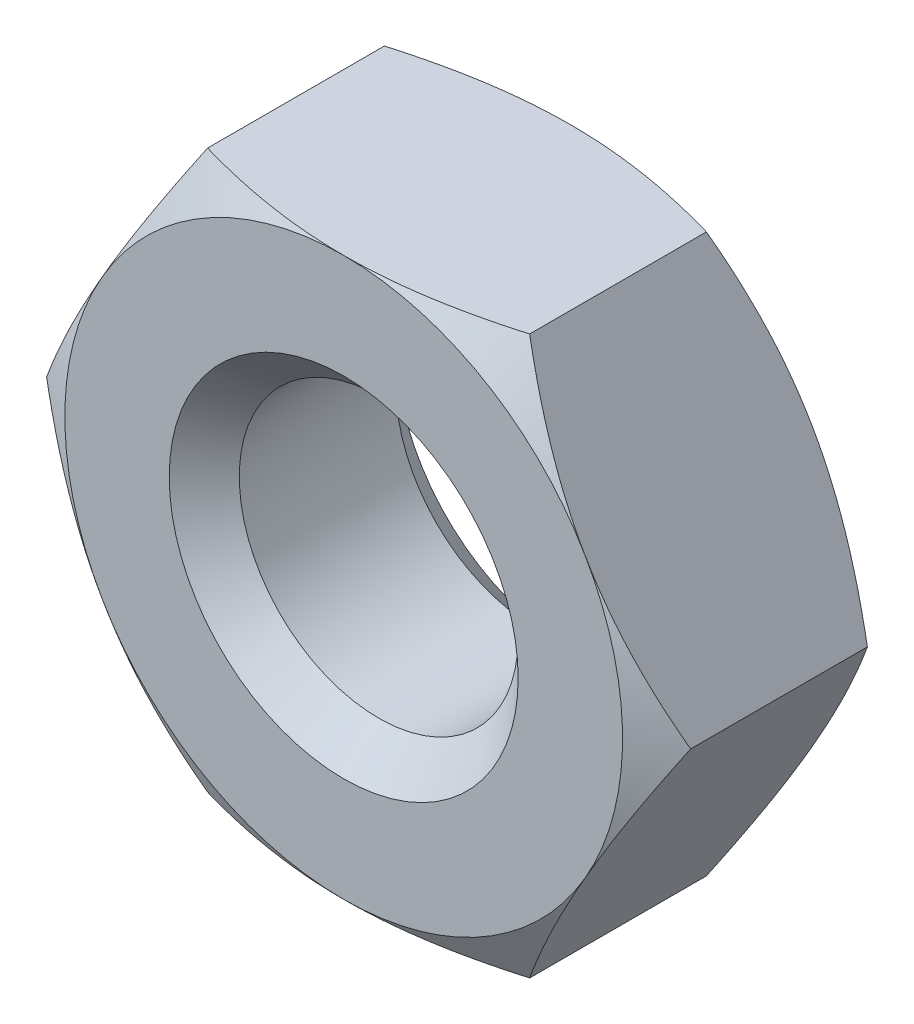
ISO-10303-21;
HEADER;
FILE_DESCRIPTION(('STEP AP214'),'2;1');
FILE_NAME('part.step','',(''),(''),'','','');
FILE_SCHEMA(('AUTOMOTIVE_DESIGN { 1 0 10303 214 1 1 1 1 }'));
ENDSEC;
DATA;
#1=APPLICATION_CONTEXT('core data for automotive mechanical design processes');
#2=APPLICATION_PROTOCOL_DEFINITION('international standard','automotive_design',2000,#1);
#3=PRODUCT_CONTEXT('',#1,'mechanical');
#4=PRODUCT('Part','Part','',(#3));
#5=PRODUCT_RELATED_PRODUCT_CATEGORY('part','',(#4));
#6=PRODUCT_DEFINITION_FORMATION('','',#4);
#7=PRODUCT_DEFINITION_CONTEXT('part definition',#1,'design');
#8=PRODUCT_DEFINITION('design','',#6,#7);
#9=PRODUCT_DEFINITION_SHAPE('','',#8);
#10=(LENGTH_UNIT() NAMED_UNIT(*) SI_UNIT(.MILLI.,.METRE.));
#11=(NAMED_UNIT(*) PLANE_ANGLE_UNIT() SI_UNIT($,.RADIAN.));
#12=(NAMED_UNIT(*) SI_UNIT($,.STERADIAN.) SOLID_ANGLE_UNIT());
#13=UNCERTAINTY_MEASURE_WITH_UNIT(LENGTH_MEASURE(1.E-05),#10,'distance_accuracy_value','');
#14=(GEOMETRIC_REPRESENTATION_CONTEXT(3) GLOBAL_UNCERTAINTY_ASSIGNED_CONTEXT((#13)) GLOBAL_UNIT_ASSIGNED_CONTEXT((#10,
#11,#12)) REPRESENTATION_CONTEXT('',''));
#15=CARTESIAN_POINT('',(0.,0.,0.));
#16=DIRECTION('',(0.,0.,1.));
#17=DIRECTION('',(1.,0.,0.));
#18=AXIS2_PLACEMENT_3D('',#15,#16,#17);
#19=CARTESIAN_POINT('',(0.,0.,1.3));
#20=DIRECTION('',(0.,0.,1.));
#21=DIRECTION('',(1.,0.,0.));
#22=AXIS2_PLACEMENT_3D('',#19,#20,#21);
#23=PLANE('',#22);
#24=CARTESIAN_POINT('',(0.,0.,1.29999999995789));
#25=DIRECTION('',(0.,0.,1.));
#26=DIRECTION('',(1.,0.,0.));
#27=AXIS2_PLACEMENT_3D('',#24,#25,#26);
#28=CIRCLE('',#27,1.00100415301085);
#29=CARTESIAN_POINT('',(1.00100415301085,0.,1.29999999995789));
#30=VERTEX_POINT('',#29);
#31=EDGE_CURVE('E127',#30,#30,#28,.F.);
#32=ORIENTED_EDGE('',*,*,#31,.T.);
#33=EDGE_LOOP('',(#32));
#34=FACE_BOUND('',#33,.T.);
#35=CARTESIAN_POINT('',(0.,0.,1.29999999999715));
#36=DIRECTION('',(0.,0.,-1.));
#37=DIRECTION('',(-1.,0.,0.));
#38=AXIS2_PLACEMENT_3D('',#35,#36,#37);
#39=CIRCLE('',#38,1.60000000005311);
#40=CARTESIAN_POINT('',(1.19651024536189E-11,1.60000000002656,1.30000000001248));
#41=VERTEX_POINT('',#40);
#42=CARTESIAN_POINT('',(1.38564064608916,0.799999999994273,1.30000000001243));
#43=VERTEX_POINT('',#42);
#44=EDGE_CURVE('E592',#41,#43,#39,.T.);
#45=ORIENTED_EDGE('',*,*,#44,.F.);
#46=CARTESIAN_POINT('',(0.,0.,1.29999999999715));
#47=DIRECTION('',(0.,0.,-1.));
#48=DIRECTION('',(-1.,0.,0.));
#49=AXIS2_PLACEMENT_3D('',#46,#47,#48);
#50=CIRCLE('',#49,1.60000000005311);
#51=CARTESIAN_POINT('',(-1.38564064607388,0.800000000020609,1.30000000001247));
#52=VERTEX_POINT('',#51);
#53=EDGE_CURVE('E593',#52,#41,#50,.T.);
#54=ORIENTED_EDGE('',*,*,#53,.F.);
#55=CARTESIAN_POINT('',(0.,0.,1.29999999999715));
#56=DIRECTION('',(0.,0.,-1.));
#57=DIRECTION('',(-1.,0.,0.));
#58=AXIS2_PLACEMENT_3D('',#55,#56,#57);
#59=CIRCLE('',#58,1.60000000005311);
#60=CARTESIAN_POINT('',(-1.38564064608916,-0.799999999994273,1.30000000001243));
#61=VERTEX_POINT('',#60);
#62=EDGE_CURVE('E122',#61,#52,#59,.T.);
#63=ORIENTED_EDGE('',*,*,#62,.F.);
#64=CARTESIAN_POINT('',(0.,0.,1.29999999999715));
#65=DIRECTION('',(0.,0.,-1.));
#66=DIRECTION('',(-1.,0.,0.));
#67=AXIS2_PLACEMENT_3D('',#64,#65,#66);
#68=CIRCLE('',#67,1.60000000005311);
#69=CARTESIAN_POINT('',(-1.19652485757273E-11,-1.60000000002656,1.30000000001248));
#70=VERTEX_POINT('',#69);
#71=EDGE_CURVE('E119',#70,#61,#68,.T.);
#72=ORIENTED_EDGE('',*,*,#71,.F.);
#73=CARTESIAN_POINT('',(0.,0.,1.29999999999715));
#74=DIRECTION('',(0.,0.,-1.));
#75=DIRECTION('',(-1.,0.,0.));
#76=AXIS2_PLACEMENT_3D('',#73,#74,#75);
#77=CIRCLE('',#76,1.60000000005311);
#78=CARTESIAN_POINT('',(1.38564064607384,-0.800000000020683,1.30000000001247));
#79=VERTEX_POINT('',#78);
#80=EDGE_CURVE('E20',#79,#70,#77,.T.);
#81=ORIENTED_EDGE('',*,*,#80,.F.);
#82=CARTESIAN_POINT('',(0.,0.,1.29999999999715));
#83=DIRECTION('',(0.,0.,-1.));
#84=DIRECTION('',(-1.,0.,0.));
#85=AXIS2_PLACEMENT_3D('',#82,#83,#84);
#86=CIRCLE('',#85,1.60000000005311);
#87=EDGE_CURVE('E104',#43,#79,#86,.T.);
#88=ORIENTED_EDGE('',*,*,#87,.F.);
#89=EDGE_LOOP('',(#45,#54,#63,#72,#81,#88));
#90=FACE_BOUND('',#89,.T.);
#91=ADVANCED_FACE('F17',(#34,#90),#23,.T.);
#92=CARTESIAN_POINT('',(0.,0.,1.15623632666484));
#93=DIRECTION('',(0.,0.,-1.));
#94=DIRECTION('',(-1.,0.,0.));
#95=AXIS2_PLACEMENT_3D('',#92,#93,#94);
#96=CONICAL_SURFACE('',#95,1.84900598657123,1.04719755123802);
#97=CARTESIAN_POINT('',(0.923760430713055,-1.59999999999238,1.15709376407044));
#98=CARTESIAN_POINT('',(0.848553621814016,-1.59999999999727,1.17880404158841));
#99=CARTESIAN_POINT('',(0.772764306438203,-1.59999999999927,1.19869688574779));
#100=CARTESIAN_POINT('',(0.620517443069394,-1.60000000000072,1.23377774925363));
#101=CARTESIAN_POINT('',(0.544065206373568,-1.60000000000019,1.24898903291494));
#102=CARTESIAN_POINT('',(0.390141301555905,-1.59999999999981,1.27388971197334));
#103=CARTESIAN_POINT('',(0.312668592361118,-1.59999999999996,1.2835729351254));
#104=CARTESIAN_POINT('',(0.1958784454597,-1.60000000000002,1.29337167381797));
#105=CARTESIAN_POINT('',(0.156749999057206,-1.60000000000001,1.29585047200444));
#106=CARTESIAN_POINT('',(0.0784161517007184,-1.59999999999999,1.29916729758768));
#107=CARTESIAN_POINT('',(0.0392107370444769,-1.59999999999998,1.30000500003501));
#108=CARTESIAN_POINT('',(-1.23193674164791E-11,-1.6,1.30000000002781));
#109=B_SPLINE_CURVE_WITH_KNOTS('',3,(#97,#98,#99,#100,#101,#102,#103,#104,#105,#106,#107,#108),
.UNSPECIFIED.,.F.,.F.,(4,2,2,2,2,4),(0.,0.234891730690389,0.468596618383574,0.702561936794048,
0.820151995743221,0.93776533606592),.UNSPECIFIED.);
#110=CARTESIAN_POINT('',(0.923760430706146,-1.60000000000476,1.15709376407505));
#111=VERTEX_POINT('',#110);
#112=EDGE_CURVE('E113',#111,#70,#109,.T.);
#113=ORIENTED_EDGE('',*,*,#112,.F.);
#114=CARTESIAN_POINT('',(1.38564064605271,-0.800000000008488,1.30000000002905));
#115=CARTESIAN_POINT('',(1.36603527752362,-0.833957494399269,1.30000500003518));
#116=CARTESIAN_POINT('',(1.34643257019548,-0.867910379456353,1.29916729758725));
#117=CARTESIAN_POINT('',(1.30726564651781,-0.935749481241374,1.29585047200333));
#118=CARTESIAN_POINT('',(1.28770142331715,-0.969635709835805,1.29337167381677));
#119=CARTESIAN_POINT('',(1.229306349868,-1.0707789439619,1.28357293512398));
#120=CARTESIAN_POINT('',(1.1905699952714,-1.137872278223,1.27388971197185));
#121=CARTESIAN_POINT('',(1.11360804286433,-1.27117429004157,1.24898903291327));
#122=CARTESIAN_POINT('',(1.07538192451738,-1.33738386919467,1.23377774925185));
#123=CARTESIAN_POINT('',(0.999258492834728,-1.4692335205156,1.19869688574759));
#124=CARTESIAN_POINT('',(0.961363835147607,-1.53486899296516,1.1788040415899));
#125=CARTESIAN_POINT('',(0.923760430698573,-1.60000000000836,1.15709376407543));
#126=B_SPLINE_CURVE_WITH_KNOTS('',3,(#114,#115,#116,#117,#118,#119,#120,#121,#122,#123,#124,
#125),.UNSPECIFIED.,.F.,.F.,(4,2,2,2,2,4),(0.,0.117613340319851,0.235203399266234,
0.469168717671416,0.702873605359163,0.937765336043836),.UNSPECIFIED.);
#127=EDGE_CURVE('E115',#79,#111,#126,.T.);
#128=ORIENTED_EDGE('',*,*,#127,.F.);
#129=ORIENTED_EDGE('',*,*,#80,.T.);
#130=EDGE_LOOP('',(#113,#128,#129));
#131=FACE_BOUND('',#130,.T.);
#132=ADVANCED_FACE('F111',(#131),#96,.T.);
#133=CARTESIAN_POINT('',(0.,0.,1.15623632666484));
#134=DIRECTION('',(0.,0.,-1.));
#135=DIRECTION('',(-1.,0.,0.));
#136=AXIS2_PLACEMENT_3D('',#133,#134,#135);
#137=CONICAL_SURFACE('',#136,1.84900598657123,1.04719755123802);
#138=CARTESIAN_POINT('',(1.84752086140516,1.22068261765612E-11,1.15709376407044));
#139=CARTESIAN_POINT('',(1.80991745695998,-0.0651310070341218,1.17880404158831));
#140=CARTESIAN_POINT('',(1.77202279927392,-0.130766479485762,1.19869688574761));
#141=CARTESIAN_POINT('',(1.69589936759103,-0.262616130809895,1.23377774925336));
#142=CARTESIAN_POINT('',(1.6576732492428,-0.328825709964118,1.24898903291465));
#143=CARTESIAN_POINT('',(1.58071129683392,-0.462127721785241,1.27388971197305));
#144=CARTESIAN_POINT('',(1.54197494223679,-0.529221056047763,1.28357293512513));
#145=CARTESIAN_POINT('',(1.48357986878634,-0.63036429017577,1.29337167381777));
#146=CARTESIAN_POINT('',(1.46401564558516,-0.664250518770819,1.29585047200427));
#147=CARTESIAN_POINT('',(1.42484872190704,-0.732089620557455,1.29916729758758));
#148=CARTESIAN_POINT('',(1.40524601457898,-0.766042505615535,1.30000500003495));
#149=CARTESIAN_POINT('',(1.38564064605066,-0.800000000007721,1.3000000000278));
#150=B_SPLINE_CURVE_WITH_KNOTS('',3,(#138,#139,#140,#141,#142,#143,#144,#145,#146,#147,#148,
#149),.UNSPECIFIED.,.F.,.F.,(4,2,2,2,2,4),(0.,0.234891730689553,0.468596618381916,
0.702561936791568,0.820151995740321,0.937765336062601),.UNSPECIFIED.);
#151=CARTESIAN_POINT('',(1.84752086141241,0.,1.15709376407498));
#152=VERTEX_POINT('',#151);
#153=EDGE_CURVE('E253',#152,#79,#150,.T.);
#154=ORIENTED_EDGE('',*,*,#153,.F.);
#155=CARTESIAN_POINT('',(1.38564064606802,0.799999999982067,1.30000000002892));
#156=CARTESIAN_POINT('',(1.40524601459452,0.76604250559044,1.30000500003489));
#157=CARTESIAN_POINT('',(1.4248487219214,0.732089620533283,1.29916729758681));
#158=CARTESIAN_POINT('',(1.46401564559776,0.664250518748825,1.29585047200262));
#159=CARTESIAN_POINT('',(1.48357986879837,0.63036429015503,1.29337167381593));
#160=CARTESIAN_POINT('',(1.54197494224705,0.529221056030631,1.28357293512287));
#161=CARTESIAN_POINT('',(1.5807112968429,0.462127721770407,1.27388971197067));
#162=CARTESIAN_POINT('',(1.65767324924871,0.328825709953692,1.24898903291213));
#163=CARTESIAN_POINT('',(1.69589936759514,0.262616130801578,1.23377774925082));
#164=CARTESIAN_POINT('',(1.77202279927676,0.1307664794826,1.19869688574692));
#165=CARTESIAN_POINT('',(1.80991745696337,0.0651310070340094,1.17880404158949));
#166=CARTESIAN_POINT('',(1.84752086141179,-8.29758985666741E-12,1.15709376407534));
#167=B_SPLINE_CURVE_WITH_KNOTS('',3,(#155,#156,#157,#158,#159,#160,#161,#162,#163,#164,#165,
#166),.UNSPECIFIED.,.F.,.F.,(4,2,2,2,2,4),(0.,0.117613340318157,0.235203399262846,
0.469168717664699,0.702873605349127,0.937765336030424),.UNSPECIFIED.);
#168=EDGE_CURVE('E273',#43,#152,#167,.T.);
#169=ORIENTED_EDGE('',*,*,#168,.F.);
#170=ORIENTED_EDGE('',*,*,#87,.T.);
#171=EDGE_LOOP('',(#154,#169,#170));
#172=FACE_BOUND('',#171,.T.);
#173=ADVANCED_FACE('F265',(#172),#137,.T.);
#174=CARTESIAN_POINT('',(0.,0.,1.15623632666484));
#175=DIRECTION('',(0.,0.,-1.));
#176=DIRECTION('',(-1.,0.,0.));
#177=AXIS2_PLACEMENT_3D('',#174,#175,#176);
#178=CONICAL_SURFACE('',#177,1.84900598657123,1.04719755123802);
#179=CARTESIAN_POINT('',(0.923760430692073,1.60000000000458,1.15709376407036));
#180=CARTESIAN_POINT('',(0.961363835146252,1.53486899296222,1.17880404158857));
#181=CARTESIAN_POINT('',(0.999258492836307,1.46923352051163,1.19869688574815));
#182=CARTESIAN_POINT('',(1.0753819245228,1.33738386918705,1.23377774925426));
#183=CARTESIAN_POINT('',(1.11360804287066,1.27117429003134,1.24898903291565));
#184=CARTESIAN_POINT('',(1.19056999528,1.13787227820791,1.27388971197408));
#185=CARTESIAN_POINT('',(1.22930634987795,1.07077894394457,1.28357293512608));
#186=CARTESIAN_POINT('',(1.28770142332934,0.969635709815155,1.29337167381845));
#187=CARTESIAN_POINT('',(1.3072656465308,0.935749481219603,1.29585047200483));
#188=CARTESIAN_POINT('',(1.34643257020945,0.867910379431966,1.29916729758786));
#189=CARTESIAN_POINT('',(1.36603527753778,0.833957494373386,1.30000500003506));
#190=CARTESIAN_POINT('',(1.3856406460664,0.799999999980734,1.30000000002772));
#191=B_SPLINE_CURVE_WITH_KNOTS('',3,(#179,#180,#181,#182,#183,#184,#185,#186,#187,#188,#189,
#190),.UNSPECIFIED.,.F.,.F.,(4,2,2,2,2,4),(0.,0.234891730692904,0.468596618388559,
0.702561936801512,0.820151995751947,0.937765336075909),.UNSPECIFIED.);
#192=CARTESIAN_POINT('',(0.923760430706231,1.60000000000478,1.15709376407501));
#193=VERTEX_POINT('',#192);
#194=EDGE_CURVE('E279',#193,#43,#191,.T.);
#195=ORIENTED_EDGE('',*,*,#194,.F.);
#196=CARTESIAN_POINT('',(1.19651184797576E-11,1.60000000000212,1.30000000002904));
#197=CARTESIAN_POINT('',(0.0392107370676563,1.60000000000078,1.30000500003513));
#198=CARTESIAN_POINT('',(0.0784161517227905,1.60000000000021,1.29916729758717));
#199=CARTESIAN_POINT('',(0.156749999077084,1.59999999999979,1.29585047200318));
#200=CARTESIAN_POINT('',(0.195878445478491,1.59999999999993,1.29337167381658));
#201=CARTESIAN_POINT('',(0.312668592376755,1.60000000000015,1.28357293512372));
#202=CARTESIAN_POINT('',(0.390141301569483,1.60000000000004,1.27388971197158));
#203=CARTESIAN_POINT('',(0.544065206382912,1.59999999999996,1.248989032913));
#204=CARTESIAN_POINT('',(0.620517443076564,1.59999999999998,1.23377774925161));
#205=CARTESIAN_POINT('',(0.772764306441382,1.60000000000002,1.19869688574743));
#206=CARTESIAN_POINT('',(0.848553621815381,1.60000000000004,1.17880404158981));
#207=CARTESIAN_POINT('',(0.923760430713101,1.6,1.15709376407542));
#208=B_SPLINE_CURVE_WITH_KNOTS('',3,(#196,#197,#198,#199,#200,#201,#202,#203,#204,#205,#206,
#207),.UNSPECIFIED.,.F.,.F.,(4,2,2,2,2,4),(0.,0.117613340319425,0.235203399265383,
0.469168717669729,0.702873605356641,0.937765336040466),.UNSPECIFIED.);
#209=EDGE_CURVE('E285',#41,#193,#208,.T.);
#210=ORIENTED_EDGE('',*,*,#209,.F.);
#211=ORIENTED_EDGE('',*,*,#44,.T.);
#212=EDGE_LOOP('',(#195,#210,#211));
#213=FACE_BOUND('',#212,.T.);
#214=ADVANCED_FACE('F270',(#213),#178,.T.);
#215=CARTESIAN_POINT('',(0.,0.,1.15623632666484));
#216=DIRECTION('',(0.,0.,-1.));
#217=DIRECTION('',(-1.,0.,0.));
#218=AXIS2_PLACEMENT_3D('',#215,#216,#217);
#219=CONICAL_SURFACE('',#218,1.84900598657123,1.04719755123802);
#220=CARTESIAN_POINT('',(-0.923760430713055,1.59999999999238,1.15709376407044));
#221=CARTESIAN_POINT('',(-0.848553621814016,1.59999999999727,1.17880404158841));
#222=CARTESIAN_POINT('',(-0.772764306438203,1.59999999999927,1.19869688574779));
#223=CARTESIAN_POINT('',(-0.620517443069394,1.60000000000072,1.23377774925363));
#224=CARTESIAN_POINT('',(-0.544065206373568,1.60000000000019,1.24898903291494));
#225=CARTESIAN_POINT('',(-0.390141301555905,1.59999999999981,1.27388971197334));
#226=CARTESIAN_POINT('',(-0.312668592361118,1.59999999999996,1.2835729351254));
#227=CARTESIAN_POINT('',(-0.1958784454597,1.60000000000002,1.29337167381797));
#228=CARTESIAN_POINT('',(-0.156749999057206,1.60000000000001,1.29585047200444));
#229=CARTESIAN_POINT('',(-0.0784161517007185,1.59999999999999,1.29916729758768));
#230=CARTESIAN_POINT('',(-0.0392107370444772,1.59999999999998,1.30000500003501));
#231=CARTESIAN_POINT('',(1.23191844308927E-11,1.6,1.30000000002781));
#232=B_SPLINE_CURVE_WITH_KNOTS('',3,(#220,#221,#222,#223,#224,#225,#226,#227,#228,#229,#230,
#231),.UNSPECIFIED.,.F.,.F.,(4,2,2,2,2,4),(0.,0.234891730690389,0.468596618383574,
0.702561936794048,0.82015199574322,0.937765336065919),.UNSPECIFIED.);
#233=CARTESIAN_POINT('',(-0.923760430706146,1.60000000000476,1.15709376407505));
#234=VERTEX_POINT('',#233);
#235=EDGE_CURVE('E291',#234,#41,#232,.T.);
#236=ORIENTED_EDGE('',*,*,#235,.F.);
#237=CARTESIAN_POINT('',(-1.38564064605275,0.800000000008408,1.30000000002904));
#238=CARTESIAN_POINT('',(-1.36603527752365,0.833957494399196,1.30000500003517));
#239=CARTESIAN_POINT('',(-1.34643257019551,0.867910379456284,1.29916729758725));
#240=CARTESIAN_POINT('',(-1.30726564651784,0.935749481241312,1.29585047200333));
#241=CARTESIAN_POINT('',(-1.28770142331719,0.969635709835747,1.29337167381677));
#242=CARTESIAN_POINT('',(-1.22930634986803,1.07077894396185,1.28357293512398));
#243=CARTESIAN_POINT('',(-1.19056999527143,1.13787227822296,1.27388971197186));
#244=CARTESIAN_POINT('',(-1.11360804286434,1.27117429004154,1.24898903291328));
#245=CARTESIAN_POINT('',(-1.07538192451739,1.33738386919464,1.23377774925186));
#246=CARTESIAN_POINT('',(-0.999258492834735,1.46923352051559,1.19869688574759));
#247=CARTESIAN_POINT('',(-0.961363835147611,1.53486899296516,1.1788040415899));
#248=CARTESIAN_POINT('',(-0.923760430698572,1.60000000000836,1.15709376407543));
#249=B_SPLINE_CURVE_WITH_KNOTS('',3,(#237,#238,#239,#240,#241,#242,#243,#244,#245,#246,#247,
#248),.UNSPECIFIED.,.F.,.F.,(4,2,2,2,2,4),(0.,0.117613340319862,0.235203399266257,
0.46916871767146,0.702873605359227,0.937765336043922),.UNSPECIFIED.);
#250=EDGE_CURVE('E390',#52,#234,#249,.T.);
#251=ORIENTED_EDGE('',*,*,#250,.F.);
#252=ORIENTED_EDGE('',*,*,#53,.T.);
#253=EDGE_LOOP('',(#236,#251,#252));
#254=FACE_BOUND('',#253,.T.);
#255=ADVANCED_FACE('F533',(#254),#219,.T.);
#256=CARTESIAN_POINT('',(0.,0.,1.15623632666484));
#257=DIRECTION('',(0.,0.,-1.));
#258=DIRECTION('',(-1.,0.,0.));
#259=AXIS2_PLACEMENT_3D('',#256,#257,#258);
#260=CONICAL_SURFACE('',#259,1.84900598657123,1.04719755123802);
#261=CARTESIAN_POINT('',(-1.84752086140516,-1.21961704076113E-11,1.15709376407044));
#262=CARTESIAN_POINT('',(-1.80991745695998,0.0651310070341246,1.17880404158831));
#263=CARTESIAN_POINT('',(-1.77202279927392,0.130766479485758,1.19869688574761));
#264=CARTESIAN_POINT('',(-1.69589936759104,0.262616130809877,1.23377774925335));
#265=CARTESIAN_POINT('',(-1.65767324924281,0.328825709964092,1.24898903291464));
#266=CARTESIAN_POINT('',(-1.58071129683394,0.462127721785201,1.27388971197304));
#267=CARTESIAN_POINT('',(-1.54197494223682,0.529221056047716,1.28357293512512));
#268=CARTESIAN_POINT('',(-1.48357986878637,0.630364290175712,1.29337167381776));
#269=CARTESIAN_POINT('',(-1.46401564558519,0.664250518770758,1.29585047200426));
#270=CARTESIAN_POINT('',(-1.42484872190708,0.732089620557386,1.29916729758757));
#271=CARTESIAN_POINT('',(-1.40524601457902,0.766042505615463,1.30000500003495));
#272=CARTESIAN_POINT('',(-1.38564064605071,0.800000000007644,1.3000000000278));
#273=B_SPLINE_CURVE_WITH_KNOTS('',3,(#261,#262,#263,#264,#265,#266,#267,#268,#269,#270,#271,
#272),.UNSPECIFIED.,.F.,.F.,(4,2,2,2,2,4),(0.,0.234891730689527,0.468596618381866,
0.702561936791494,0.820151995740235,0.937765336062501),.UNSPECIFIED.);
#274=CARTESIAN_POINT('',(-1.84752086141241,0.,1.15709376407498));
#275=VERTEX_POINT('',#274);
#276=EDGE_CURVE('E389',#275,#52,#273,.T.);
#277=ORIENTED_EDGE('',*,*,#276,.F.);
#278=CARTESIAN_POINT('',(-1.38564064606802,-0.799999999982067,1.30000000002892));
#279=CARTESIAN_POINT('',(-1.40524601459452,-0.766042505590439,1.30000500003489));
#280=CARTESIAN_POINT('',(-1.4248487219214,-0.732089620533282,1.29916729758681));
#281=CARTESIAN_POINT('',(-1.46401564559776,-0.664250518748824,1.29585047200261));
#282=CARTESIAN_POINT('',(-1.48357986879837,-0.630364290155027,1.29337167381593));
#283=CARTESIAN_POINT('',(-1.54197494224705,-0.529221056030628,1.28357293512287));
#284=CARTESIAN_POINT('',(-1.58071129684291,-0.462127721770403,1.27388971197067));
#285=CARTESIAN_POINT('',(-1.65767324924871,-0.328825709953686,1.24898903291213));
#286=CARTESIAN_POINT('',(-1.69589936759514,-0.262616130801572,1.23377774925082));
#287=CARTESIAN_POINT('',(-1.77202279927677,-0.130766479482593,1.19869688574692));
#288=CARTESIAN_POINT('',(-1.80991745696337,-0.065131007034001,1.17880404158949));
#289=CARTESIAN_POINT('',(-1.8475208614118,8.30657991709E-12,1.15709376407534));
#290=B_SPLINE_CURVE_WITH_KNOTS('',3,(#278,#279,#280,#281,#282,#283,#284,#285,#286,#287,#288,
#289),.UNSPECIFIED.,.F.,.F.,(4,2,2,2,2,4),(0.,0.117613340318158,0.235203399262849,
0.469168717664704,0.702873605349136,0.937765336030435),.UNSPECIFIED.);
#291=EDGE_CURVE('E177',#61,#275,#290,.T.);
#292=ORIENTED_EDGE('',*,*,#291,.F.);
#293=ORIENTED_EDGE('',*,*,#62,.T.);
#294=EDGE_LOOP('',(#277,#292,#293));
#295=FACE_BOUND('',#294,.T.);
#296=ADVANCED_FACE('F158',(#295),#260,.T.);
#297=CARTESIAN_POINT('',(0.,0.,1.15623632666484));
#298=DIRECTION('',(0.,0.,-1.));
#299=DIRECTION('',(-1.,0.,0.));
#300=AXIS2_PLACEMENT_3D('',#297,#298,#299);
#301=CONICAL_SURFACE('',#300,1.84900598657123,1.04719755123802);
#302=CARTESIAN_POINT('',(-0.923760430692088,-1.60000000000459,1.15709376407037));
#303=CARTESIAN_POINT('',(-0.961363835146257,-1.53486899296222,1.17880404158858));
#304=CARTESIAN_POINT('',(-0.999258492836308,-1.46923352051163,1.19869688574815));
#305=CARTESIAN_POINT('',(-1.0753819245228,-1.33738386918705,1.23377774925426));
#306=CARTESIAN_POINT('',(-1.11360804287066,-1.27117429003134,1.24898903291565));
#307=CARTESIAN_POINT('',(-1.19056999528,-1.13787227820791,1.27388971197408));
#308=CARTESIAN_POINT('',(-1.22930634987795,-1.07077894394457,1.28357293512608));
#309=CARTESIAN_POINT('',(-1.28770142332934,-0.969635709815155,1.29337167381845));
#310=CARTESIAN_POINT('',(-1.3072656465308,-0.935749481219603,1.29585047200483));
#311=CARTESIAN_POINT('',(-1.34643257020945,-0.867910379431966,1.29916729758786));
#312=CARTESIAN_POINT('',(-1.36603527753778,-0.833957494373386,1.30000500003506));
#313=CARTESIAN_POINT('',(-1.3856406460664,-0.799999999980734,1.30000000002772));
#314=B_SPLINE_CURVE_WITH_KNOTS('',3,(#302,#303,#304,#305,#306,#307,#308,#309,#310,#311,#312,
#313),.UNSPECIFIED.,.F.,.F.,(4,2,2,2,2,4),(0.,0.234891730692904,0.468596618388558,
0.702561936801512,0.820151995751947,0.937765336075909),.UNSPECIFIED.);
#315=CARTESIAN_POINT('',(-0.923760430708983,-1.60000000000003,1.15709376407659));
#316=VERTEX_POINT('',#315);
#317=EDGE_CURVE('E138',#316,#61,#314,.T.);
#318=ORIENTED_EDGE('',*,*,#317,.F.);
#319=CARTESIAN_POINT('',(-1.19652513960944E-11,-1.60000000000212,1.30000000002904));
#320=CARTESIAN_POINT('',(-0.0392107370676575,-1.60000000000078,1.30000500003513));
#321=CARTESIAN_POINT('',(-0.0784161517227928,-1.60000000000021,1.29916729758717));
#322=CARTESIAN_POINT('',(-0.156749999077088,-1.59999999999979,1.29585047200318));
#323=CARTESIAN_POINT('',(-0.195878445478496,-1.59999999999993,1.29337167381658));
#324=CARTESIAN_POINT('',(-0.312668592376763,-1.60000000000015,1.28357293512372));
#325=CARTESIAN_POINT('',(-0.390141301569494,-1.60000000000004,1.27388971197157));
#326=CARTESIAN_POINT('',(-0.544065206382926,-1.59999999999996,1.248989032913));
#327=CARTESIAN_POINT('',(-0.62051744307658,-1.59999999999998,1.2337777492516));
#328=CARTESIAN_POINT('',(-0.772764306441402,-1.60000000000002,1.19869688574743));
#329=CARTESIAN_POINT('',(-0.848553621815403,-1.60000000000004,1.1788040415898));
#330=CARTESIAN_POINT('',(-0.923760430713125,-1.6,1.15709376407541));
#331=B_SPLINE_CURVE_WITH_KNOTS('',3,(#319,#320,#321,#322,#323,#324,#325,#326,#327,#328,#329,
#330),.UNSPECIFIED.,.F.,.F.,(4,2,2,2,2,4),(0.,0.117613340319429,0.23520339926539,
0.469168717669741,0.702873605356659,0.937765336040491),.UNSPECIFIED.);
#332=EDGE_CURVE('E132',#70,#316,#331,.T.);
#333=ORIENTED_EDGE('',*,*,#332,.F.);
#334=ORIENTED_EDGE('',*,*,#71,.T.);
#335=EDGE_LOOP('',(#318,#333,#334));
#336=FACE_BOUND('',#335,.T.);
#337=ADVANCED_FACE('F137',(#336),#301,.T.);
#338=CARTESIAN_POINT('',(0.,0.,1.29999999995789));
#339=DIRECTION('',(0.,0.,1.));
#340=DIRECTION('',(1.,0.,0.));
#341=AXIS2_PLACEMENT_3D('',#338,#339,#340);
#342=CONICAL_SURFACE('',#341,1.00100415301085,0.785899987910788);
#343=CARTESIAN_POINT('',(0.,0.,1.09919748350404));
#344=DIRECTION('',(0.,0.,1.));
#345=DIRECTION('',(1.,0.,0.));
#346=AXIS2_PLACEMENT_3D('',#343,#344,#345);
#347=CIRCLE('',#346,0.8);
#348=CARTESIAN_POINT('',(0.8,0.,1.09919748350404));
#349=VERTEX_POINT('',#348);
#350=EDGE_CURVE('E169',#349,#349,#347,.F.);
#351=ORIENTED_EDGE('',*,*,#350,.T.);
#352=EDGE_LOOP('',(#351));
#353=FACE_BOUND('',#352,.T.);
#354=ORIENTED_EDGE('',*,*,#31,.F.);
#355=EDGE_LOOP('',(#354));
#356=FACE_BOUND('',#355,.T.);
#357=ADVANCED_FACE('F157',(#353,#356),#342,.F.);
#358=CARTESIAN_POINT('',(-0.9237604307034,-1.6,0.));
#359=DIRECTION('',(0.,-1.,0.));
#360=DIRECTION('',(0.,0.,-1.));
#361=AXIS2_PLACEMENT_3D('',#358,#359,#360);
#362=PLANE('',#361);
#363=DIRECTION('',(0.,0.,1.));
#364=VECTOR('',#363,1.);
#365=CARTESIAN_POINT('',(0.9237604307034,-1.6,0.));
#366=LINE('',#365,#364);
#367=CARTESIAN_POINT('',(0.923760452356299,-1.59999996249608,0.142906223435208));
#368=VERTEX_POINT('',#367);
#369=EDGE_CURVE('E135',#111,#368,#366,.F.);
#370=ORIENTED_EDGE('',*,*,#369,.F.);
#371=ORIENTED_EDGE('',*,*,#112,.T.);
#372=ORIENTED_EDGE('',*,*,#332,.T.);
#373=DIRECTION('',(0.,0.,1.));
#374=VECTOR('',#373,1.);
#375=CARTESIAN_POINT('',(-0.923760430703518,-1.60000000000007,0.));
#376=LINE('',#375,#374);
#377=CARTESIAN_POINT('',(-0.923760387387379,-1.60000000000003,0.142906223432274));
#378=VERTEX_POINT('',#377);
#379=EDGE_CURVE('E170',#378,#316,#376,.T.);
#380=ORIENTED_EDGE('',*,*,#379,.F.);
#381=CARTESIAN_POINT('',(-1.19654773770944E-11,-1.6000000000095,-1.85602668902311E-11));
#382=CARTESIAN_POINT('',(-0.0392107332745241,-1.6000000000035,-5.00002003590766E-06));
#383=CARTESIAN_POINT('',(-0.0784161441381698,-1.60000000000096,0.000832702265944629));
#384=CARTESIAN_POINT('',(-0.156749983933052,-1.59999999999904,0.00414952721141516));
#385=CARTESIAN_POINT('',(-0.195878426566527,-1.59999999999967,0.00662832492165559));
#386=CARTESIAN_POINT('',(-0.312668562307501,-1.60000000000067,0.0164270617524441));
#387=CARTESIAN_POINT('',(-0.390141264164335,-1.60000000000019,0.0261102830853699));
#388=CARTESIAN_POINT('',(-0.54406515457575,-1.59999999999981,0.0510109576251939));
#389=CARTESIAN_POINT('',(-0.620517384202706,-1.5999999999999,0.0662222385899));
#390=CARTESIAN_POINT('',(-0.772764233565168,-1.6000000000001,0.101303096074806));
#391=CARTESIAN_POINT('',(-0.848553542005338,-1.60000000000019,0.12119593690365));
#392=CARTESIAN_POINT('',(-0.92376034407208,-1.6,0.142906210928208));
#393=B_SPLINE_CURVE_WITH_KNOTS('',3,(#381,#382,#383,#384,#385,#386,#387,#388,#389,#390,#391,
#392),.UNSPECIFIED.,.F.,.F.,(4,2,2,2,2,4),(0.,0.117613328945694,0.235203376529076,
0.469168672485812,0.702873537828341,0.937765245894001),.UNSPECIFIED.);
#394=CARTESIAN_POINT('',(-1.19656554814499E-11,-1.60000000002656,2.25462201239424E-12));
#395=VERTEX_POINT('',#394);
#396=EDGE_CURVE('E171',#395,#378,#393,.T.);
#397=ORIENTED_EDGE('',*,*,#396,.F.);
#398=CARTESIAN_POINT('',(0.923760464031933,-1.6,0.142906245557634));
#399=CARTESIAN_POINT('',(0.848553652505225,-1.6,0.121195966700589));
#400=CARTESIAN_POINT('',(0.772764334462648,-1.6,0.101303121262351));
#401=CARTESIAN_POINT('',(0.620517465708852,-1.6,0.066222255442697));
#402=CARTESIAN_POINT('',(0.544065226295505,-1.6,0.0510109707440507));
#403=CARTESIAN_POINT('',(0.390141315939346,-1.6,0.0261102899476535));
#404=CARTESIAN_POINT('',(0.31266860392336,-1.6,0.0164270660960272));
#405=CARTESIAN_POINT('',(0.19587845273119,-1.6,0.00662832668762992));
#406=CARTESIAN_POINT('',(0.156750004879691,-1.6,0.00414952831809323));
#407=CARTESIAN_POINT('',(0.0784161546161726,-1.6,0.000832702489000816));
#408=CARTESIAN_POINT('',(0.0392107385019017,-1.6,-5.00002104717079E-06));
#409=CARTESIAN_POINT('',(-1.3547744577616E-11,-1.6,-1.30781790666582E-11));
#410=B_SPLINE_CURVE_WITH_KNOTS('',3,(#398,#399,#400,#401,#402,#403,#404,#405,#406,#407,#408,
#409),.UNSPECIFIED.,.F.,.F.,(4,2,2,2,2,4),(0.,0.234891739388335,0.468596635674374,
0.702561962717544,0.82015202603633,0.937765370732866),.UNSPECIFIED.);
#411=EDGE_CURVE('E228',#368,#395,#410,.T.);
#412=ORIENTED_EDGE('',*,*,#411,.F.);
#413=EDGE_LOOP('',(#370,#371,#372,#380,#397,#412));
#414=FACE_BOUND('',#413,.T.);
#415=ADVANCED_FACE('F130',(#414),#362,.T.);
#416=CARTESIAN_POINT('',(0.9237604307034,-1.6,0.));
#417=DIRECTION('',(0.866025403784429,-0.500000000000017,0.));
#418=DIRECTION('',(0.500000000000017,0.866025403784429,0.));
#419=AXIS2_PLACEMENT_3D('',#416,#417,#418);
#420=PLANE('',#419);
#421=DIRECTION('',(0.,0.,1.));
#422=VECTOR('',#421,1.);
#423=CARTESIAN_POINT('',(1.847520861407,0.,0.));
#424=LINE('',#423,#422);
#425=CARTESIAN_POINT('',(1.84752085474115,1.15455982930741E-08,0.142906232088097));
#426=VERTEX_POINT('',#425);
#427=EDGE_CURVE('E278',#152,#426,#424,.F.);
#428=ORIENTED_EDGE('',*,*,#427,.F.);
#429=ORIENTED_EDGE('',*,*,#153,.T.);
#430=ORIENTED_EDGE('',*,*,#127,.T.);
#431=ORIENTED_EDGE('',*,*,#369,.T.);
#432=CARTESIAN_POINT('',(1.38564064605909,-0.800000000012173,-1.85686808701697E-11));
#433=CARTESIAN_POINT('',(1.36603527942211,-0.833957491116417,-5.0000200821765E-06));
#434=CARTESIAN_POINT('',(1.34643257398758,-0.867910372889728,0.000832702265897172));
#435=CARTESIAN_POINT('',(1.30726565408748,-0.935749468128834,0.00414952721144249));
#436=CARTESIAN_POINT('',(1.28770143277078,-0.969635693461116,0.00662832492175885));
#437=CARTESIAN_POINT('',(1.2293063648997,-1.07077891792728,0.0164270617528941));
#438=CARTESIAN_POINT('',(1.1905700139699,-1.13787224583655,0.0261102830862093));
#439=CARTESIAN_POINT('',(1.11360806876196,-1.27117424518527,0.0510109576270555));
#440=CARTESIAN_POINT('',(1.07538195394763,-1.33738381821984,0.0662222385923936));
#441=CARTESIAN_POINT('',(0.999258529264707,-1.46923345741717,0.101303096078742));
#442=CARTESIAN_POINT('',(0.961363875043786,-1.53486892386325,0.121195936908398));
#443=CARTESIAN_POINT('',(0.923760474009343,-1.59999992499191,0.142906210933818));
#444=B_SPLINE_CURVE_WITH_KNOTS('',3,(#432,#433,#434,#435,#436,#437,#438,#439,#440,#441,#442,
#443),.UNSPECIFIED.,.F.,.F.,(4,2,2,2,2,4),(0.,0.117613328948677,0.235203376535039,
0.469168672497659,0.702873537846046,0.93776524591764),.UNSPECIFIED.);
#445=CARTESIAN_POINT('',(1.38564064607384,-0.800000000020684,2.25943939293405E-12));
#446=VERTEX_POINT('',#445);
#447=EDGE_CURVE('E208',#446,#368,#444,.T.);
#448=ORIENTED_EDGE('',*,*,#447,.F.);
#449=CARTESIAN_POINT('',(1.84752084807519,-2.30910941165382E-08,0.142906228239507));
#450=CARTESIAN_POINT('',(1.80991744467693,-0.0651310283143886,0.121195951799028));
#451=CARTESIAN_POINT('',(1.77202278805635,-0.130766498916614,0.10130310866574));
#452=CARTESIAN_POINT('',(1.69589935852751,-0.262616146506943,0.066222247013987));
#453=CARTESIAN_POINT('',(1.65767324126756,-0.328825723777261,0.0510109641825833));
#454=CARTESIAN_POINT('',(1.5807112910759,-0.462127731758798,0.0261102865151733));
#455=CARTESIAN_POINT('',(1.5419749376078,-0.529221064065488,0.0164270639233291));
#456=CARTESIAN_POINT('',(1.48357986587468,-0.630364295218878,0.00662832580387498));
#457=CARTESIAN_POINT('',(1.46401564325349,-0.664250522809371,0.00414952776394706));
#458=CARTESIAN_POINT('',(1.42484872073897,-0.732089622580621,0.000832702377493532));
#459=CARTESIAN_POINT('',(1.40524601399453,-0.766042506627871,-5.00001965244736E-06));
#460=CARTESIAN_POINT('',(1.38564064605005,-0.800000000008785,-1.30684591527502E-11));
#461=B_SPLINE_CURVE_WITH_KNOTS('',3,(#449,#450,#451,#452,#453,#454,#455,#456,#457,#458,#459,
#460),.UNSPECIFIED.,.F.,.F.,(4,2,2,2,2,4),(0.,0.234891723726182,0.46859660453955,
0.70256191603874,0.8201519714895,0.937765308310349),.UNSPECIFIED.);
#462=EDGE_CURVE('E233',#426,#446,#461,.T.);
#463=ORIENTED_EDGE('',*,*,#462,.F.);
#464=EDGE_LOOP('',(#428,#429,#430,#431,#448,#463));
#465=FACE_BOUND('',#464,.T.);
#466=ADVANCED_FACE('F244',(#465),#420,.T.);
#467=CARTESIAN_POINT('',(1.847520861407,0.,0.));
#468=DIRECTION('',(0.866025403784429,0.500000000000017,0.));
#469=DIRECTION('',(-0.500000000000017,0.866025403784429,0.));
#470=AXIS2_PLACEMENT_3D('',#467,#468,#469);
#471=PLANE('',#470);
#472=DIRECTION('',(0.,0.,1.));
#473=VECTOR('',#472,1.);
#474=CARTESIAN_POINT('',(0.9237604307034,1.6,0.));
#475=LINE('',#474,#473);
#476=CARTESIAN_POINT('',(0.923760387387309,1.6,0.142906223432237));
#477=VERTEX_POINT('',#476);
#478=EDGE_CURVE('E290',#193,#477,#475,.F.);
#479=ORIENTED_EDGE('',*,*,#478,.F.);
#480=ORIENTED_EDGE('',*,*,#194,.T.);
#481=ORIENTED_EDGE('',*,*,#168,.T.);
#482=ORIENTED_EDGE('',*,*,#427,.T.);
#483=CARTESIAN_POINT('',(1.38564064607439,0.799999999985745,-1.84321110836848E-11));
#484=CARTESIAN_POINT('',(1.40524601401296,0.766042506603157,-5.00002112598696E-06));
#485=CARTESIAN_POINT('',(1.42484872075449,0.73208962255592,0.00083270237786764));
#486=CARTESIAN_POINT('',(1.46401564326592,0.664250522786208,0.00414952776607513));
#487=CARTESIAN_POINT('',(1.48357986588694,0.630364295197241,0.00662832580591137));
#488=CARTESIAN_POINT('',(1.54197493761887,0.529221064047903,0.0164270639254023));
#489=CARTESIAN_POINT('',(1.5807112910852,0.462127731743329,0.0261102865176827));
#490=CARTESIAN_POINT('',(1.65767324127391,0.328825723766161,0.0510109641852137));
#491=CARTESIAN_POINT('',(1.69589935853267,0.262616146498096,0.066222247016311));
#492=CARTESIAN_POINT('',(1.7720227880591,0.130766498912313,0.101303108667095));
#493=CARTESIAN_POINT('',(1.80991744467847,0.0651310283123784,0.121195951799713));
#494=CARTESIAN_POINT('',(1.84752084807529,2.30911966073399E-08,0.142906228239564));
#495=B_SPLINE_CURVE_WITH_KNOTS('',3,(#483,#484,#485,#486,#487,#488,#489,#490,#491,#492,#493,
#494),.UNSPECIFIED.,.F.,.F.,(4,2,2,2,2,4),(0.,0.117613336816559,0.235203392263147,
0.46916870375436,0.702873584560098,0.937765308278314),.UNSPECIFIED.);
#496=CARTESIAN_POINT('',(1.38564064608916,0.799999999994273,2.29877859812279E-12));
#497=VERTEX_POINT('',#496);
#498=EDGE_CURVE('E238',#497,#426,#495,.T.);
#499=ORIENTED_EDGE('',*,*,#498,.F.);
#500=CARTESIAN_POINT('',(0.923760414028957,1.60000002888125,0.142906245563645));
#501=CARTESIAN_POINT('',(0.961363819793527,1.53486901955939,0.12119596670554));
#502=CARTESIAN_POINT('',(0.999258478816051,1.46923354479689,0.101303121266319));
#503=CARTESIAN_POINT('',(1.07538191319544,1.33738388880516,0.0662222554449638));
#504=CARTESIAN_POINT('',(1.11360803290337,1.27117430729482,0.0510109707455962));
#505=CARTESIAN_POINT('',(1.190569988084,1.13787229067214,0.0261102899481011));
#506=CARTESIAN_POINT('',(1.22930634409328,1.07077895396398,0.0164270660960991));
#507=CARTESIAN_POINT('',(1.28770141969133,0.969635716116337,0.0066283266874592));
#508=CARTESIAN_POINT('',(1.30726564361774,0.935749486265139,0.00414952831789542));
#509=CARTESIAN_POINT('',(1.34643256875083,0.867910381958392,0.000832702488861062));
#510=CARTESIAN_POINT('',(1.36603527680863,0.833957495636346,-5.00002110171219E-06));
#511=CARTESIAN_POINT('',(1.38564064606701,0.799999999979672,-1.29898862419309E-11));
#512=B_SPLINE_CURVE_WITH_KNOTS('',3,(#500,#501,#502,#503,#504,#505,#506,#507,#508,#509,#510,
#511),.UNSPECIFIED.,.F.,.F.,(4,2,2,2,2,4),(0.,0.234891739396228,0.468596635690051,
0.702561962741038,0.820152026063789,0.937765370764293),.UNSPECIFIED.);
#513=EDGE_CURVE('E316',#477,#497,#512,.T.);
#514=ORIENTED_EDGE('',*,*,#513,.F.);
#515=EDGE_LOOP('',(#479,#480,#481,#482,#499,#514));
#516=FACE_BOUND('',#515,.T.);
#517=ADVANCED_FACE('F247',(#516),#471,.T.);
#518=CARTESIAN_POINT('',(0.9237604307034,1.6,0.));
#519=DIRECTION('',(0.,1.,0.));
#520=DIRECTION('',(0.,0.,1.));
#521=AXIS2_PLACEMENT_3D('',#518,#519,#520);
#522=PLANE('',#521);
#523=DIRECTION('',(0.,0.,1.));
#524=VECTOR('',#523,1.);
#525=CARTESIAN_POINT('',(-0.9237604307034,1.6,0.));
#526=LINE('',#525,#524);
#527=CARTESIAN_POINT('',(-0.923760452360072,1.59999996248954,0.14290622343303));
#528=VERTEX_POINT('',#527);
#529=EDGE_CURVE('E387',#234,#528,#526,.F.);
#530=ORIENTED_EDGE('',*,*,#529,.F.);
#531=ORIENTED_EDGE('',*,*,#235,.T.);
#532=ORIENTED_EDGE('',*,*,#209,.T.);
#533=ORIENTED_EDGE('',*,*,#478,.T.);
#534=CARTESIAN_POINT('',(1.19650241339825E-11,1.6000000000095,-1.85602838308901E-11));
#535=CARTESIAN_POINT('',(0.0392107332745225,1.6000000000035,-5.00002003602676E-06));
#536=CARTESIAN_POINT('',(0.0784161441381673,1.60000000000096,0.000832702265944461));
#537=CARTESIAN_POINT('',(0.156749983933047,1.59999999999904,0.00414952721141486));
#538=CARTESIAN_POINT('',(0.195878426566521,1.59999999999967,0.00662832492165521));
#539=CARTESIAN_POINT('',(0.312668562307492,1.60000000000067,0.0164270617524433));
#540=CARTESIAN_POINT('',(0.390141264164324,1.60000000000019,0.0261102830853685));
#541=CARTESIAN_POINT('',(0.544065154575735,1.59999999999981,0.0510109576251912));
#542=CARTESIAN_POINT('',(0.62051738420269,1.5999999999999,0.0662222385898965));
#543=CARTESIAN_POINT('',(0.772764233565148,1.6000000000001,0.101303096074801));
#544=CARTESIAN_POINT('',(0.848553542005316,1.60000000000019,0.121195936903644));
#545=CARTESIAN_POINT('',(0.923760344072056,1.6,0.142906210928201));
#546=B_SPLINE_CURVE_WITH_KNOTS('',3,(#534,#535,#536,#537,#538,#539,#540,#541,#542,#543,#544,
#545),.UNSPECIFIED.,.F.,.F.,(4,2,2,2,2,4),(0.,0.117613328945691,0.235203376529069,
0.4691686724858,0.702873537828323,0.937765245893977),.UNSPECIFIED.);
#547=CARTESIAN_POINT('',(1.19649756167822E-11,1.60000000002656,2.2546198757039E-12));
#548=VERTEX_POINT('',#547);
#549=EDGE_CURVE('E310',#548,#477,#546,.T.);
#550=ORIENTED_EDGE('',*,*,#549,.F.);
#551=CARTESIAN_POINT('',(-0.923760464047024,1.6,0.14290624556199));
#552=CARTESIAN_POINT('',(-0.848553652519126,1.6,0.121195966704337));
#553=CARTESIAN_POINT('',(-0.772764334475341,1.6,0.10130312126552));
#554=CARTESIAN_POINT('',(-0.620517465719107,1.6,0.0662222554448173));
#555=CARTESIAN_POINT('',(-0.544065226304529,1.6,0.0510109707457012));
#556=CARTESIAN_POINT('',(-0.390141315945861,1.6,0.026110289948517));
#557=CARTESIAN_POINT('',(-0.312668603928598,1.6,0.0164270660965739));
#558=CARTESIAN_POINT('',(-0.195878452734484,1.6,0.00662832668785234));
#559=CARTESIAN_POINT('',(-0.156750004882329,1.6,0.00414952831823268));
#560=CARTESIAN_POINT('',(-0.0784161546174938,1.6,0.000832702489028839));
#561=CARTESIAN_POINT('',(-0.0392107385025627,1.6,-5.00002104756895E-06));
#562=CARTESIAN_POINT('',(1.35474646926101E-11,1.6,-1.30781687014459E-11));
#563=B_SPLINE_CURVE_WITH_KNOTS('',3,(#551,#552,#553,#554,#555,#556,#557,#558,#559,#560,#561,
#562),.UNSPECIFIED.,.F.,.F.,(4,2,2,2,2,4),(0.,0.234891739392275,0.468596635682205,
0.702561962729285,0.82015202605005,0.937765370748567),.UNSPECIFIED.);
#564=EDGE_CURVE('E304',#528,#548,#563,.T.);
#565=ORIENTED_EDGE('',*,*,#564,.F.);
#566=EDGE_LOOP('',(#530,#531,#532,#533,#550,#565));
#567=FACE_BOUND('',#566,.T.);
#568=ADVANCED_FACE('F296',(#567),#522,.T.);
#569=CARTESIAN_POINT('',(-0.9237604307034,1.6,0.));
#570=DIRECTION('',(-0.866025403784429,0.500000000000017,0.));
#571=DIRECTION('',(-0.500000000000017,-0.866025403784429,0.));
#572=AXIS2_PLACEMENT_3D('',#569,#570,#571);
#573=PLANE('',#572);
#574=DIRECTION('',(0.,0.,1.));
#575=VECTOR('',#574,1.);
#576=CARTESIAN_POINT('',(-1.847520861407,0.,0.));
#577=LINE('',#576,#575);
#578=CARTESIAN_POINT('',(-1.84752086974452,1.44410162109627E-08,0.142906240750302));
#579=VERTEX_POINT('',#578);
#580=EDGE_CURVE('E384',#275,#579,#577,.F.);
#581=ORIENTED_EDGE('',*,*,#580,.F.);
#582=ORIENTED_EDGE('',*,*,#276,.T.);
#583=ORIENTED_EDGE('',*,*,#250,.T.);
#584=ORIENTED_EDGE('',*,*,#529,.T.);
#585=CARTESIAN_POINT('',(-1.38564064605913,0.800000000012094,-1.85634353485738E-11));
#586=CARTESIAN_POINT('',(-1.36603527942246,0.833957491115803,-5.00002008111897E-06));
#587=CARTESIAN_POINT('',(-1.34643257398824,0.867910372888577,0.000832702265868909));
#588=CARTESIAN_POINT('',(-1.30726565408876,0.935749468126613,0.00414952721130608));
#589=CARTESIAN_POINT('',(-1.28770143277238,0.969635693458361,0.00662832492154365));
#590=CARTESIAN_POINT('',(-1.2293063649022,1.07077891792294,0.0164270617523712));
#591=CARTESIAN_POINT('',(-1.190570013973,1.13787224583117,0.0261102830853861));
#592=CARTESIAN_POINT('',(-1.11360806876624,1.27117424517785,0.0510109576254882));
#593=CARTESIAN_POINT('',(-1.07538195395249,1.33738381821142,0.0662222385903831));
#594=CARTESIAN_POINT('',(-0.999258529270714,1.46923345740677,0.101303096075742));
#595=CARTESIAN_POINT('',(-0.96136387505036,1.53486892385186,0.121195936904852));
#596=CARTESIAN_POINT('',(-0.923760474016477,1.59999992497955,0.142906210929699));
#597=B_SPLINE_CURVE_WITH_KNOTS('',3,(#585,#586,#587,#588,#589,#590,#591,#592,#593,#594,#595,
#596),.UNSPECIFIED.,.F.,.F.,(4,2,2,2,2,4),(0.,0.117613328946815,0.235203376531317,
0.469168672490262,0.702873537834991,0.937765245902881),.UNSPECIFIED.);
#598=CARTESIAN_POINT('',(-1.38564064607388,0.800000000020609,2.25962178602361E-12));
#599=VERTEX_POINT('',#598);
#600=EDGE_CURVE('E333',#599,#528,#597,.T.);
#601=ORIENTED_EDGE('',*,*,#600,.F.);
#602=CARTESIAN_POINT('',(-1.84752081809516,7.50283733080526E-08,0.142906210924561));
#603=CARTESIAN_POINT('',(-1.80991741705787,0.0651310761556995,0.121195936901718));
#604=CARTESIAN_POINT('',(-1.77202276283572,0.130766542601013,0.101303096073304));
#605=CARTESIAN_POINT('',(-1.69589933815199,0.262616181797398,0.0662222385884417));
#606=CARTESIAN_POINT('',(-1.65767322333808,0.328825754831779,0.0510109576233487));
#607=CARTESIAN_POINT('',(-1.58071127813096,0.462127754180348,0.0261102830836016));
#608=CARTESIAN_POINT('',(-1.54197492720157,0.529221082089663,0.0164270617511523));
#609=CARTESIAN_POINT('',(-1.48357985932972,0.630364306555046,0.00662832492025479));
#610=CARTESIAN_POINT('',(-1.46401563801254,0.664250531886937,0.00414952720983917));
#611=CARTESIAN_POINT('',(-1.42484871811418,0.7320896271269,0.000832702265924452));
#612=CARTESIAN_POINT('',(-1.40524601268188,0.766042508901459,-5.0000183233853E-06));
#613=CARTESIAN_POINT('',(-1.38564064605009,0.800000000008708,-1.30684088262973E-11));
#614=B_SPLINE_CURVE_WITH_KNOTS('',3,(#602,#603,#604,#605,#606,#607,#608,#609,#610,#611,#612,
#613),.UNSPECIFIED.,.F.,.F.,(4,2,2,2,2,4),(0.,0.234891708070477,0.468596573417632,
0.702561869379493,0.82015191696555,0.937765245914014),.UNSPECIFIED.);
#615=EDGE_CURVE('E35',#579,#599,#614,.T.);
#616=ORIENTED_EDGE('',*,*,#615,.F.);
#617=EDGE_LOOP('',(#581,#582,#583,#584,#601,#616));
#618=FACE_BOUND('',#617,.T.);
#619=ADVANCED_FACE('F188',(#618),#573,.T.);
#620=CARTESIAN_POINT('',(-1.847520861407,0.,0.));
#621=DIRECTION('',(-0.866025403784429,-0.500000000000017,0.));
#622=DIRECTION('',(0.500000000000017,-0.866025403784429,0.));
#623=AXIS2_PLACEMENT_3D('',#620,#621,#622);
#624=PLANE('',#623);
#625=ORIENTED_EDGE('',*,*,#379,.T.);
#626=ORIENTED_EDGE('',*,*,#317,.T.);
#627=ORIENTED_EDGE('',*,*,#291,.T.);
#628=ORIENTED_EDGE('',*,*,#580,.T.);
#629=CARTESIAN_POINT('',(-1.38564064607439,-0.799999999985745,-1.84322814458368E-11));
#630=CARTESIAN_POINT('',(-1.40524601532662,-0.766042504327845,-5.00002246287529E-06));
#631=CARTESIAN_POINT('',(-1.42484872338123,-0.732089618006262,0.000832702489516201));
#632=CARTESIAN_POINT('',(-1.46401564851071,-0.66425051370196,0.00414952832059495));
#633=CARTESIAN_POINT('',(-1.48357987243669,-0.630364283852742,0.00662832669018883));
#634=CARTESIAN_POINT('',(-1.54197494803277,-0.529221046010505,0.016427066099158));
#635=CARTESIAN_POINT('',(-1.58071130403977,-0.462127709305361,0.0261102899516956));
#636=CARTESIAN_POINT('',(-1.65767325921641,-0.328825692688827,0.0510109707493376));
#637=CARTESIAN_POINT('',(-1.69589937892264,-0.262616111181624,0.0662222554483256));
#638=CARTESIAN_POINT('',(-1.77202281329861,-0.130766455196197,0.101303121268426));
#639=CARTESIAN_POINT('',(-1.80991747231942,-0.0651309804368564,0.121195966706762));
#640=CARTESIAN_POINT('',(-1.84752087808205,2.88820320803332E-08,0.142906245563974));
#641=B_SPLINE_CURVE_WITH_KNOTS('',3,(#629,#630,#631,#632,#633,#634,#635,#636,#637,#638,#639,
#640),.UNSPECIFIED.,.F.,.F.,(4,2,2,2,2,4),(0.,0.117613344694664,0.235203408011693,
0.469168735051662,0.702873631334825,0.937765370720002),.UNSPECIFIED.);
#642=CARTESIAN_POINT('',(-1.38564064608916,-0.799999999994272,2.29883354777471E-12));
#643=VERTEX_POINT('',#642);
#644=EDGE_CURVE('E196',#643,#579,#641,.T.);
#645=ORIENTED_EDGE('',*,*,#644,.F.);
#646=CARTESIAN_POINT('',(-0.923760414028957,-1.60000002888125,0.142906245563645));
#647=CARTESIAN_POINT('',(-0.961363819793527,-1.53486901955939,0.12119596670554));
#648=CARTESIAN_POINT('',(-0.999258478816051,-1.46923354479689,0.101303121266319));
#649=CARTESIAN_POINT('',(-1.07538191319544,-1.33738388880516,0.0662222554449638));
#650=CARTESIAN_POINT('',(-1.11360803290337,-1.27117430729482,0.0510109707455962));
#651=CARTESIAN_POINT('',(-1.190569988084,-1.13787229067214,0.0261102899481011));
#652=CARTESIAN_POINT('',(-1.22930634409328,-1.07077895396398,0.0164270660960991));
#653=CARTESIAN_POINT('',(-1.28770141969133,-0.969635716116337,0.0066283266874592));
#654=CARTESIAN_POINT('',(-1.30726564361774,-0.935749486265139,0.0041495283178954));
#655=CARTESIAN_POINT('',(-1.34643256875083,-0.867910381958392,0.000832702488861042));
#656=CARTESIAN_POINT('',(-1.36603527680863,-0.833957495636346,-5.00002110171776E-06));
#657=CARTESIAN_POINT('',(-1.38564064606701,-0.799999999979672,-1.29898455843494E-11));
#658=B_SPLINE_CURVE_WITH_KNOTS('',3,(#646,#647,#648,#649,#650,#651,#652,#653,#654,#655,#656,
#657),.UNSPECIFIED.,.F.,.F.,(4,2,2,2,2,4),(0.,0.234891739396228,0.468596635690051,
0.702561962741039,0.820152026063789,0.937765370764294),.UNSPECIFIED.);
#659=EDGE_CURVE('E203',#378,#643,#658,.T.);
#660=ORIENTED_EDGE('',*,*,#659,.F.);
#661=EDGE_LOOP('',(#625,#626,#627,#628,#645,#660));
#662=FACE_BOUND('',#661,.T.);
#663=ADVANCED_FACE('F182',(#662),#624,.T.);
#664=CARTESIAN_POINT('',(0.,0.,0.));
#665=DIRECTION('',(0.,0.,1.));
#666=DIRECTION('',(1.,0.,0.));
#667=AXIS2_PLACEMENT_3D('',#664,#665,#666);
#668=CYLINDRICAL_SURFACE('',#667,0.8);
#669=ORIENTED_EDGE('',*,*,#350,.F.);
#670=EDGE_LOOP('',(#669));
#671=FACE_BOUND('',#670,.T.);
#672=CARTESIAN_POINT('',(0.,0.,0.200802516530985));
#673=DIRECTION('',(0.,0.,-1.));
#674=DIRECTION('',(0.,-1.,0.));
#675=AXIS2_PLACEMENT_3D('',#672,#673,#674);
#676=CIRCLE('',#675,0.800000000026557);
#677=CARTESIAN_POINT('',(0.,-0.800000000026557,0.200802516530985));
#678=VERTEX_POINT('',#677);
#679=EDGE_CURVE('E370',#678,#678,#676,.T.);
#680=ORIENTED_EDGE('',*,*,#679,.T.);
#681=EDGE_LOOP('',(#680));
#682=FACE_BOUND('',#681,.T.);
#683=ADVANCED_FACE('F187',(#671,#682),#668,.F.);
#684=CARTESIAN_POINT('',(0.,0.,0.143763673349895));
#685=DIRECTION('',(0.,0.,1.));
#686=DIRECTION('',(1.,0.,0.));
#687=AXIS2_PLACEMENT_3D('',#684,#685,#686);
#688=CONICAL_SURFACE('',#687,1.84900598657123,1.04719755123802);
#689=ORIENTED_EDGE('',*,*,#396,.T.);
#690=ORIENTED_EDGE('',*,*,#659,.T.);
#691=CARTESIAN_POINT('',(0.,0.,1.75875752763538E-11));
#692=DIRECTION('',(0.,0.,1.));
#693=DIRECTION('',(1.,0.,0.));
#694=AXIS2_PLACEMENT_3D('',#691,#692,#693);
#695=CIRCLE('',#694,1.60000000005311);
#696=EDGE_CURVE('E366',#643,#395,#695,.T.);
#697=ORIENTED_EDGE('',*,*,#696,.T.);
#698=EDGE_LOOP('',(#689,#690,#697));
#699=FACE_BOUND('',#698,.T.);
#700=ADVANCED_FACE('F214',(#699),#688,.T.);
#701=CARTESIAN_POINT('',(0.,0.,0.143763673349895));
#702=DIRECTION('',(0.,0.,1.));
#703=DIRECTION('',(1.,0.,0.));
#704=AXIS2_PLACEMENT_3D('',#701,#702,#703);
#705=CONICAL_SURFACE('',#704,1.84900598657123,1.04719755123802);
#706=ORIENTED_EDGE('',*,*,#447,.T.);
#707=ORIENTED_EDGE('',*,*,#411,.T.);
#708=CARTESIAN_POINT('',(0.,0.,1.75874397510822E-11));
#709=DIRECTION('',(0.,0.,1.));
#710=DIRECTION('',(1.,0.,0.));
#711=AXIS2_PLACEMENT_3D('',#708,#709,#710);
#712=CIRCLE('',#711,1.60000000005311);
#713=EDGE_CURVE('E364',#395,#446,#712,.T.);
#714=ORIENTED_EDGE('',*,*,#713,.T.);
#715=EDGE_LOOP('',(#706,#707,#714));
#716=FACE_BOUND('',#715,.T.);
#717=ADVANCED_FACE('F217',(#716),#705,.T.);
#718=CARTESIAN_POINT('',(0.,0.,0.143763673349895));
#719=DIRECTION('',(0.,0.,1.));
#720=DIRECTION('',(1.,0.,0.));
#721=AXIS2_PLACEMENT_3D('',#718,#719,#720);
#722=CONICAL_SURFACE('',#721,1.84900598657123,1.04719755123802);
#723=CARTESIAN_POINT('',(0.,0.,1.75873042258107E-11));
#724=DIRECTION('',(0.,0.,1.));
#725=DIRECTION('',(1.,0.,0.));
#726=AXIS2_PLACEMENT_3D('',#723,#724,#725);
#727=CIRCLE('',#726,1.60000000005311);
#728=EDGE_CURVE('E358',#446,#497,#727,.T.);
#729=ORIENTED_EDGE('',*,*,#728,.T.);
#730=ORIENTED_EDGE('',*,*,#498,.T.);
#731=ORIENTED_EDGE('',*,*,#462,.T.);
#732=EDGE_LOOP('',(#729,#730,#731));
#733=FACE_BOUND('',#732,.T.);
#734=ADVANCED_FACE('F223',(#733),#722,.T.);
#735=CARTESIAN_POINT('',(0.,0.,0.143763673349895));
#736=DIRECTION('',(0.,0.,1.));
#737=DIRECTION('',(1.,0.,0.));
#738=AXIS2_PLACEMENT_3D('',#735,#736,#737);
#739=CONICAL_SURFACE('',#738,1.84900598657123,1.04719755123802);
#740=ORIENTED_EDGE('',*,*,#549,.T.);
#741=ORIENTED_EDGE('',*,*,#513,.T.);
#742=CARTESIAN_POINT('',(0.,0.,1.75874397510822E-11));
#743=DIRECTION('',(0.,0.,1.));
#744=DIRECTION('',(1.,0.,0.));
#745=AXIS2_PLACEMENT_3D('',#742,#743,#744);
#746=CIRCLE('',#745,1.60000000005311);
#747=EDGE_CURVE('E344',#497,#548,#746,.T.);
#748=ORIENTED_EDGE('',*,*,#747,.T.);
#749=EDGE_LOOP('',(#740,#741,#748));
#750=FACE_BOUND('',#749,.T.);
#751=ADVANCED_FACE('F320',(#750),#739,.T.);
#752=CARTESIAN_POINT('',(0.,0.,0.143763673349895));
#753=DIRECTION('',(0.,0.,1.));
#754=DIRECTION('',(1.,0.,0.));
#755=AXIS2_PLACEMENT_3D('',#752,#753,#754);
#756=CONICAL_SURFACE('',#755,1.84900598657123,1.04719755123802);
#757=ORIENTED_EDGE('',*,*,#600,.T.);
#758=ORIENTED_EDGE('',*,*,#564,.T.);
#759=CARTESIAN_POINT('',(0.,0.,1.75874397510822E-11));
#760=DIRECTION('',(0.,0.,1.));
#761=DIRECTION('',(1.,0.,0.));
#762=AXIS2_PLACEMENT_3D('',#759,#760,#761);
#763=CIRCLE('',#762,1.60000000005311);
#764=EDGE_CURVE('E361',#548,#599,#763,.T.);
#765=ORIENTED_EDGE('',*,*,#764,.T.);
#766=EDGE_LOOP('',(#757,#758,#765));
#767=FACE_BOUND('',#766,.T.);
#768=ADVANCED_FACE('F323',(#767),#756,.T.);
#769=CARTESIAN_POINT('',(0.,0.,0.143763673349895));
#770=DIRECTION('',(0.,0.,1.));
#771=DIRECTION('',(1.,0.,0.));
#772=AXIS2_PLACEMENT_3D('',#769,#770,#771);
#773=CONICAL_SURFACE('',#772,1.84900598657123,1.04719755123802);
#774=CARTESIAN_POINT('',(0.,0.,1.7587683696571E-11));
#775=DIRECTION('',(0.,0.,1.));
#776=DIRECTION('',(1.,0.,0.));
#777=AXIS2_PLACEMENT_3D('',#774,#775,#776);
#778=CIRCLE('',#777,1.60000000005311);
#779=EDGE_CURVE('E26',#599,#643,#778,.T.);
#780=ORIENTED_EDGE('',*,*,#779,.T.);
#781=ORIENTED_EDGE('',*,*,#644,.T.);
#782=ORIENTED_EDGE('',*,*,#615,.T.);
#783=EDGE_LOOP('',(#780,#781,#782));
#784=FACE_BOUND('',#783,.T.);
#785=ADVANCED_FACE('F328',(#784),#773,.T.);
#786=CARTESIAN_POINT('',(0.,0.,1.13686837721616E-10));
#787=DIRECTION('',(0.,0.,-1.));
#788=DIRECTION('',(-1.,0.,0.));
#789=AXIS2_PLACEMENT_3D('',#786,#787,#788);
#790=CONICAL_SURFACE('',#789,1.00100415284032,0.785899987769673);
#791=ORIENTED_EDGE('',*,*,#679,.F.);
#792=EDGE_LOOP('',(#791));
#793=FACE_BOUND('',#792,.T.);
#794=CARTESIAN_POINT('',(0.,0.,5.69004410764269E-11));
#795=DIRECTION('',(0.,0.,-1.));
#796=DIRECTION('',(-1.,0.,0.));
#797=AXIS2_PLACEMENT_3D('',#794,#795,#796);
#798=CIRCLE('',#797,1.00100415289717);
#799=CARTESIAN_POINT('',(-1.00100415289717,0.,5.69004410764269E-11));
#800=VERTEX_POINT('',#799);
#801=EDGE_CURVE('E11',#800,#800,#798,.T.);
#802=ORIENTED_EDGE('',*,*,#801,.T.);
#803=EDGE_LOOP('',(#802));
#804=FACE_BOUND('',#803,.T.);
#805=ADVANCED_FACE('F405',(#793,#804),#790,.F.);
#806=CARTESIAN_POINT('',(0.,0.,0.));
#807=DIRECTION('',(0.,0.,1.));
#808=DIRECTION('',(1.,0.,0.));
#809=AXIS2_PLACEMENT_3D('',#806,#807,#808);
#810=PLANE('',#809);
#811=ORIENTED_EDGE('',*,*,#801,.F.);
#812=EDGE_LOOP('',(#811));
#813=FACE_BOUND('',#812,.T.);
#814=ORIENTED_EDGE('',*,*,#764,.F.);
#815=ORIENTED_EDGE('',*,*,#747,.F.);
#816=ORIENTED_EDGE('',*,*,#728,.F.);
#817=ORIENTED_EDGE('',*,*,#713,.F.);
#818=ORIENTED_EDGE('',*,*,#696,.F.);
#819=ORIENTED_EDGE('',*,*,#779,.F.);
#820=EDGE_LOOP('',(#814,#815,#816,#817,#818,#819));
#821=FACE_BOUND('',#820,.T.);
#822=ADVANCED_FACE('F356',(#813,#821),#810,.F.);
#823=CLOSED_SHELL('',(#91,#132,#173,#214,#255,#296,#337,#357,#415,#466,#517,#568,#619,#663,#683,
#700,#717,#734,#751,#768,#785,#805,#822));
#824=MANIFOLD_SOLID_BREP('B1',#823);
#825=ADVANCED_BREP_SHAPE_REPRESENTATION('',(#18,#824),#14);
#826=SHAPE_DEFINITION_REPRESENTATION(#9,#825);
ENDSEC;
END-ISO-10303-21;
